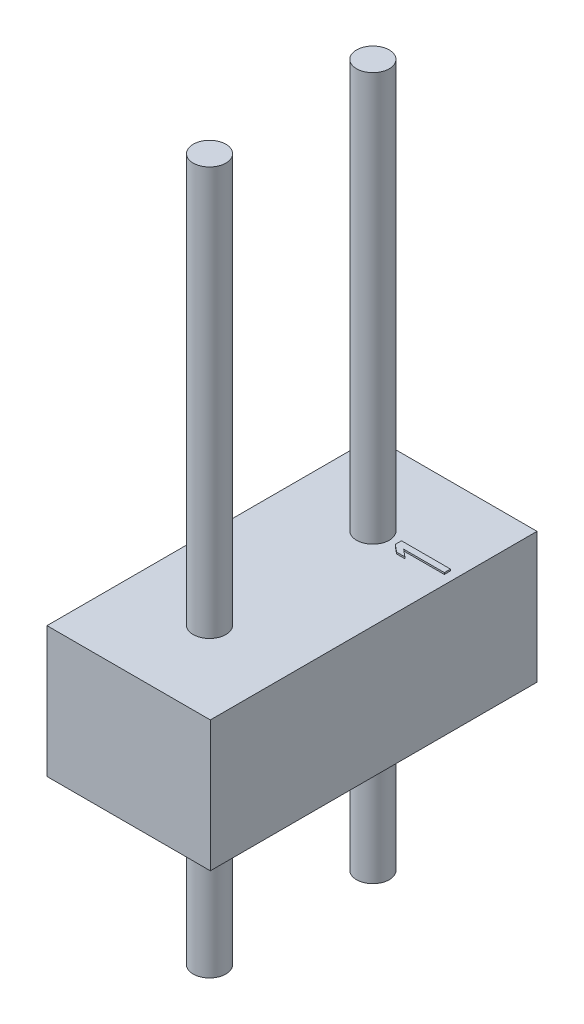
ISO-10303-21;
HEADER;
FILE_DESCRIPTION(('STEP AP214'),'2;1');
FILE_NAME('part.step','',(''),(''),'','','');
FILE_SCHEMA(('AUTOMOTIVE_DESIGN { 1 0 10303 214 1 1 1 1 }'));
ENDSEC;
DATA;
#1=APPLICATION_CONTEXT('core data for automotive mechanical design processes');
#2=APPLICATION_PROTOCOL_DEFINITION('international standard','automotive_design',2000,#1);
#3=PRODUCT_CONTEXT('',#1,'mechanical');
#4=PRODUCT('Part','Part','',(#3));
#5=PRODUCT_RELATED_PRODUCT_CATEGORY('part','',(#4));
#6=PRODUCT_DEFINITION_FORMATION('','',#4);
#7=PRODUCT_DEFINITION_CONTEXT('part definition',#1,'design');
#8=PRODUCT_DEFINITION('design','',#6,#7);
#9=PRODUCT_DEFINITION_SHAPE('','',#8);
#10=(LENGTH_UNIT() NAMED_UNIT(*) SI_UNIT(.MILLI.,.METRE.));
#11=(NAMED_UNIT(*) PLANE_ANGLE_UNIT() SI_UNIT($,.RADIAN.));
#12=(NAMED_UNIT(*) SI_UNIT($,.STERADIAN.) SOLID_ANGLE_UNIT());
#13=UNCERTAINTY_MEASURE_WITH_UNIT(LENGTH_MEASURE(1.E-05),#10,'distance_accuracy_value','');
#14=(GEOMETRIC_REPRESENTATION_CONTEXT(3) GLOBAL_UNCERTAINTY_ASSIGNED_CONTEXT((#13)) GLOBAL_UNIT_ASSIGNED_CONTEXT((#10,
#11,#12)) REPRESENTATION_CONTEXT('',''));
#15=CARTESIAN_POINT('',(0.,0.,0.));
#16=DIRECTION('',(0.,0.,1.));
#17=DIRECTION('',(1.,0.,0.));
#18=AXIS2_PLACEMENT_3D('',#15,#16,#17);
#19=CARTESIAN_POINT('',(34.0212274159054,9.906,-11.1144895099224));
#20=DIRECTION('',(0.,1.,0.));
#21=DIRECTION('',(1.,0.,0.));
#22=AXIS2_PLACEMENT_3D('',#19,#20,#21);
#23=PLANE('',#22);
#24=CARTESIAN_POINT('',(34.29,9.90599999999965,-13.97));
#25=DIRECTION('',(0.,1.,0.));
#26=DIRECTION('',(0.,0.,1.));
#27=AXIS2_PLACEMENT_3D('',#24,#25,#26);
#28=CIRCLE('',#27,0.253999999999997);
#29=CARTESIAN_POINT('',(34.29,9.90599999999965,-13.716));
#30=VERTEX_POINT('',#29);
#31=EDGE_CURVE('E20',#30,#30,#28,.T.);
#32=ORIENTED_EDGE('',*,*,#31,.T.);
#33=EDGE_LOOP('',(#32));
#34=FACE_BOUND('',#33,.T.);
#35=ADVANCED_FACE('F16',(#34),#23,.T.);
#36=CARTESIAN_POINT('',(34.0212274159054,9.906,-11.1144895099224));
#37=DIRECTION('',(0.,1.,0.));
#38=DIRECTION('',(1.,0.,0.));
#39=AXIS2_PLACEMENT_3D('',#36,#37,#38);
#40=PLANE('',#39);
#41=CARTESIAN_POINT('',(34.29,9.90599999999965,-11.43));
#42=DIRECTION('',(0.,1.,0.));
#43=DIRECTION('',(0.,0.,1.));
#44=AXIS2_PLACEMENT_3D('',#41,#42,#43);
#45=CIRCLE('',#44,0.253999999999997);
#46=CARTESIAN_POINT('',(34.29,9.90599999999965,-11.176));
#47=VERTEX_POINT('',#46);
#48=EDGE_CURVE('E162',#47,#47,#45,.T.);
#49=ORIENTED_EDGE('',*,*,#48,.T.);
#50=EDGE_LOOP('',(#49));
#51=FACE_BOUND('',#50,.T.);
#52=ADVANCED_FACE('F305',(#51),#40,.T.);
#53=CARTESIAN_POINT('',(35.44824,3.5814,-13.8282274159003));
#54=DIRECTION('',(0.,1.,0.));
#55=DIRECTION('',(0.,0.,-1.));
#56=AXIS2_PLACEMENT_3D('',#53,#54,#55);
#57=PLANE('',#56);
#58=DIRECTION('',(-1.,0.,0.));
#59=VECTOR('',#58,1.);
#60=CARTESIAN_POINT('',(35.116851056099,3.58140000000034,-13.93825));
#61=LINE('',#60,#59);
#62=CARTESIAN_POINT('',(35.4329999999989,3.58140000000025,-13.9382499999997));
#63=VERTEX_POINT('',#62);
#64=CARTESIAN_POINT('',(34.8007021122,3.58140000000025,-13.9382500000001));
#65=VERTEX_POINT('',#64);
#66=EDGE_CURVE('E143',#63,#65,#61,.T.);
#67=ORIENTED_EDGE('',*,*,#66,.F.);
#68=DIRECTION('',(0.,0.,1.));
#69=VECTOR('',#68,1.);
#70=CARTESIAN_POINT('',(35.433,3.58140000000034,-13.985875));
#71=LINE('',#70,#69);
#72=CARTESIAN_POINT('',(35.433,3.58140000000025,-14.0335000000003));
#73=VERTEX_POINT('',#72);
#74=EDGE_CURVE('E223',#73,#63,#71,.T.);
#75=ORIENTED_EDGE('',*,*,#74,.F.);
#76=DIRECTION('',(1.,0.,0.));
#77=VECTOR('',#76,1.);
#78=CARTESIAN_POINT('',(35.052,3.58140000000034,-14.0335));
#79=LINE('',#78,#77);
#80=CARTESIAN_POINT('',(34.671,3.58140000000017,-14.0335000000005));
#81=VERTEX_POINT('',#80);
#82=EDGE_CURVE('E129',#81,#73,#79,.T.);
#83=ORIENTED_EDGE('',*,*,#82,.F.);
#84=DIRECTION('',(0.,0.,-1.));
#85=VECTOR('',#84,1.);
#86=CARTESIAN_POINT('',(34.671,3.58140000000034,-13.985875));
#87=LINE('',#86,#85);
#88=CARTESIAN_POINT('',(34.6710000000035,3.58140000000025,-13.9382500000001));
#89=VERTEX_POINT('',#88);
#90=EDGE_CURVE('E136',#89,#81,#87,.T.);
#91=ORIENTED_EDGE('',*,*,#90,.F.);
#92=DIRECTION('',(-0.76597421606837,0.,-0.642871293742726));
#93=VECTOR('',#92,1.);
#94=CARTESIAN_POINT('',(34.7277446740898,3.58140000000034,-13.890625));
#95=LINE('',#94,#93);
#96=CARTESIAN_POINT('',(34.7844893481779,3.58140000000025,-13.8429999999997));
#97=VERTEX_POINT('',#96);
#98=EDGE_CURVE('E132',#97,#89,#95,.T.);
#99=ORIENTED_EDGE('',*,*,#98,.F.);
#100=DIRECTION('',(-1.,0.,0.));
#101=VECTOR('',#100,1.);
#102=CARTESIAN_POINT('',(34.8493404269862,3.58140000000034,-13.843));
#103=LINE('',#102,#101);
#104=CARTESIAN_POINT('',(34.9141915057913,3.58140000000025,-13.8429999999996));
#105=VERTEX_POINT('',#104);
#106=EDGE_CURVE('E117',#105,#97,#103,.T.);
#107=ORIENTED_EDGE('',*,*,#106,.F.);
#108=DIRECTION('',(0.765974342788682,0.,0.642871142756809));
#109=VECTOR('',#108,1.);
#110=CARTESIAN_POINT('',(34.8574468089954,3.58140000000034,-13.890625));
#111=LINE('',#110,#109);
#112=EDGE_CURVE('E114',#65,#105,#111,.T.);
#113=ORIENTED_EDGE('',*,*,#112,.F.);
#114=EDGE_LOOP('',(#67,#75,#83,#91,#99,#107,#113));
#115=FACE_BOUND('',#114,.T.);
#116=ADVANCED_FACE('F175',(#115),#57,.T.);
#117=CARTESIAN_POINT('',(34.29,3.55600000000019,-13.97));
#118=DIRECTION('',(0.,1.,0.));
#119=DIRECTION('',(0.,0.,1.));
#120=AXIS2_PLACEMENT_3D('',#117,#118,#119);
#121=CYLINDRICAL_SURFACE('',#120,0.253999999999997);
#122=ORIENTED_EDGE('',*,*,#31,.F.);
#123=EDGE_LOOP('',(#122));
#124=FACE_BOUND('',#123,.T.);
#125=CARTESIAN_POINT('',(34.29,3.55600000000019,-13.97));
#126=DIRECTION('',(0.,1.,0.));
#127=DIRECTION('',(0.,0.,1.));
#128=AXIS2_PLACEMENT_3D('',#125,#126,#127);
#129=CIRCLE('',#128,0.253999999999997);
#130=CARTESIAN_POINT('',(34.29,3.55600000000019,-13.716));
#131=VERTEX_POINT('',#130);
#132=EDGE_CURVE('E159',#131,#131,#129,.F.);
#133=ORIENTED_EDGE('',*,*,#132,.F.);
#134=EDGE_LOOP('',(#133));
#135=FACE_BOUND('',#134,.T.);
#136=ADVANCED_FACE('F171',(#124,#135),#121,.T.);
#137=CARTESIAN_POINT('',(34.29,3.55600000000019,-11.43));
#138=DIRECTION('',(0.,1.,0.));
#139=DIRECTION('',(0.,0.,1.));
#140=AXIS2_PLACEMENT_3D('',#137,#138,#139);
#141=CYLINDRICAL_SURFACE('',#140,0.253999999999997);
#142=ORIENTED_EDGE('',*,*,#48,.F.);
#143=EDGE_LOOP('',(#142));
#144=FACE_BOUND('',#143,.T.);
#145=CARTESIAN_POINT('',(34.29,3.55600000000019,-11.43));
#146=DIRECTION('',(0.,1.,0.));
#147=DIRECTION('',(0.,0.,1.));
#148=AXIS2_PLACEMENT_3D('',#145,#146,#147);
#149=CIRCLE('',#148,0.253999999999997);
#150=CARTESIAN_POINT('',(34.29,3.55600000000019,-11.176));
#151=VERTEX_POINT('',#150);
#152=EDGE_CURVE('E155',#151,#151,#149,.F.);
#153=ORIENTED_EDGE('',*,*,#152,.F.);
#154=EDGE_LOOP('',(#153));
#155=FACE_BOUND('',#154,.T.);
#156=ADVANCED_FACE('F174',(#144,#155),#141,.T.);
#157=CARTESIAN_POINT('',(35.44824,3.54122741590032,-14.0335));
#158=DIRECTION('',(0.,0.,-1.));
#159=DIRECTION('',(-1.,0.,0.));
#160=AXIS2_PLACEMENT_3D('',#157,#158,#159);
#161=PLANE('',#160);
#162=ORIENTED_EDGE('',*,*,#82,.T.);
#163=DIRECTION('',(0.,1.,0.));
#164=VECTOR('',#163,1.);
#165=CARTESIAN_POINT('',(35.433,3.5687,-14.0335000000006));
#166=LINE('',#165,#164);
#167=CARTESIAN_POINT('',(35.4329999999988,3.55599999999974,-14.0335000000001));
#168=VERTEX_POINT('',#167);
#169=EDGE_CURVE('E166',#168,#73,#166,.T.);
#170=ORIENTED_EDGE('',*,*,#169,.F.);
#171=DIRECTION('',(1.,0.,0.));
#172=VECTOR('',#171,1.);
#173=CARTESIAN_POINT('',(34.3020952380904,3.556,-14.0335));
#174=LINE('',#173,#172);
#175=CARTESIAN_POINT('',(34.6709999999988,3.55599999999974,-14.0335000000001));
#176=VERTEX_POINT('',#175);
#177=EDGE_CURVE('E158',#176,#168,#174,.T.);
#178=ORIENTED_EDGE('',*,*,#177,.F.);
#179=DIRECTION('',(0.,-1.,0.));
#180=VECTOR('',#179,1.);
#181=CARTESIAN_POINT('',(34.671,3.5687,-14.0335000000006));
#182=LINE('',#181,#180);
#183=EDGE_CURVE('E161',#81,#176,#182,.T.);
#184=ORIENTED_EDGE('',*,*,#183,.F.);
#185=EDGE_LOOP('',(#162,#170,#178,#184));
#186=FACE_BOUND('',#185,.T.);
#187=ADVANCED_FACE('F248',(#186),#161,.T.);
#188=CARTESIAN_POINT('',(35.433,3.54122741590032,-13.9234774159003));
#189=DIRECTION('',(1.,0.,0.));
#190=DIRECTION('',(0.,0.,-1.));
#191=AXIS2_PLACEMENT_3D('',#188,#189,#190);
#192=PLANE('',#191);
#193=ORIENTED_EDGE('',*,*,#74,.T.);
#194=DIRECTION('',(0.,1.,0.));
#195=VECTOR('',#194,1.);
#196=CARTESIAN_POINT('',(35.4329999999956,3.5687,-13.93825));
#197=LINE('',#196,#195);
#198=CARTESIAN_POINT('',(35.4329999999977,3.55599999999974,-13.9382499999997));
#199=VERTEX_POINT('',#198);
#200=EDGE_CURVE('E220',#199,#63,#197,.T.);
#201=ORIENTED_EDGE('',*,*,#200,.F.);
#202=DIRECTION('',(0.,0.,1.));
#203=VECTOR('',#202,1.);
#204=CARTESIAN_POINT('',(35.4329999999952,3.556,-12.7));
#205=LINE('',#204,#203);
#206=EDGE_CURVE('E141',#168,#199,#205,.T.);
#207=ORIENTED_EDGE('',*,*,#206,.F.);
#208=ORIENTED_EDGE('',*,*,#169,.T.);
#209=EDGE_LOOP('',(#193,#201,#207,#208));
#210=FACE_BOUND('',#209,.T.);
#211=ADVANCED_FACE('F229',(#210),#192,.T.);
#212=CARTESIAN_POINT('',(34.7859295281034,3.54122741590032,-13.93825));
#213=DIRECTION('',(0.,0.,1.));
#214=DIRECTION('',(1.,0.,0.));
#215=AXIS2_PLACEMENT_3D('',#212,#213,#214);
#216=PLANE('',#215);
#217=ORIENTED_EDGE('',*,*,#66,.T.);
#218=DIRECTION('',(0.,1.,0.));
#219=VECTOR('',#218,1.);
#220=CARTESIAN_POINT('',(34.8007021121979,3.5687,-13.9382500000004));
#221=LINE('',#220,#219);
#222=CARTESIAN_POINT('',(34.8007021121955,3.556,-13.9382500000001));
#223=VERTEX_POINT('',#222);
#224=EDGE_CURVE('E142',#223,#65,#221,.T.);
#225=ORIENTED_EDGE('',*,*,#224,.F.);
#226=DIRECTION('',(-1.,0.,0.));
#227=VECTOR('',#226,1.);
#228=CARTESIAN_POINT('',(34.3020952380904,3.556,-13.93825));
#229=LINE('',#228,#227);
#230=EDGE_CURVE('E97',#199,#223,#229,.T.);
#231=ORIENTED_EDGE('',*,*,#230,.F.);
#232=ORIENTED_EDGE('',*,*,#200,.T.);
#233=EDGE_LOOP('',(#217,#225,#231,#232));
#234=FACE_BOUND('',#233,.T.);
#235=ADVANCED_FACE('F239',(#234),#216,.T.);
#236=CARTESIAN_POINT('',(34.9255069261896,3.54122741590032,-13.8335031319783));
#237=DIRECTION('',(0.642871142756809,0.,-0.765974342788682));
#238=DIRECTION('',(-0.765974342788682,0.,-0.642871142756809));
#239=AXIS2_PLACEMENT_3D('',#236,#237,#238);
#240=PLANE('',#239);
#241=ORIENTED_EDGE('',*,*,#112,.T.);
#242=DIRECTION('',(0.,1.,0.));
#243=VECTOR('',#242,1.);
#244=CARTESIAN_POINT('',(34.9141915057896,3.5687,-13.843));
#245=LINE('',#244,#243);
#246=CARTESIAN_POINT('',(34.9141915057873,3.556,-13.843));
#247=VERTEX_POINT('',#246);
#248=EDGE_CURVE('E111',#247,#105,#245,.T.);
#249=ORIENTED_EDGE('',*,*,#248,.F.);
#250=DIRECTION('',(0.765974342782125,0.,0.642871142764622));
#251=VECTOR('',#250,1.);
#252=CARTESIAN_POINT('',(34.8007021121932,3.556,-13.93825));
#253=LINE('',#252,#251);
#254=EDGE_CURVE('E100',#223,#247,#253,.T.);
#255=ORIENTED_EDGE('',*,*,#254,.F.);
#256=ORIENTED_EDGE('',*,*,#224,.T.);
#257=EDGE_LOOP('',(#241,#249,#255,#256));
#258=FACE_BOUND('',#257,.T.);
#259=ADVANCED_FACE('F112',(#258),#240,.T.);
#260=CARTESIAN_POINT('',(34.769716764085,3.54122741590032,-13.843));
#261=DIRECTION('',(0.,0.,1.));
#262=DIRECTION('',(1.,0.,0.));
#263=AXIS2_PLACEMENT_3D('',#260,#261,#262);
#264=PLANE('',#263);
#265=ORIENTED_EDGE('',*,*,#106,.T.);
#266=DIRECTION('',(0.,1.,0.));
#267=VECTOR('',#266,1.);
#268=CARTESIAN_POINT('',(34.7844893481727,3.5687,-13.8429999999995));
#269=LINE('',#268,#267);
#270=CARTESIAN_POINT('',(34.7844893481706,3.556,-13.8429999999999));
#271=VERTEX_POINT('',#270);
#272=EDGE_CURVE('E121',#271,#97,#269,.T.);
#273=ORIENTED_EDGE('',*,*,#272,.F.);
#274=DIRECTION('',(-1.,0.,0.));
#275=VECTOR('',#274,1.);
#276=CARTESIAN_POINT('',(34.3020952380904,3.556,-13.843));
#277=LINE('',#276,#275);
#278=EDGE_CURVE('E105',#247,#271,#277,.T.);
#279=ORIENTED_EDGE('',*,*,#278,.F.);
#280=ORIENTED_EDGE('',*,*,#248,.T.);
#281=EDGE_LOOP('',(#265,#273,#279,#280));
#282=FACE_BOUND('',#281,.T.);
#283=ADVANCED_FACE('F119',(#282),#264,.T.);
#284=CARTESIAN_POINT('',(34.6596845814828,3.54122741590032,-13.9477468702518));
#285=DIRECTION('',(-0.642871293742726,0.,0.76597421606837));
#286=DIRECTION('',(0.76597421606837,0.,0.642871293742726));
#287=AXIS2_PLACEMENT_3D('',#284,#285,#286);
#288=PLANE('',#287);
#289=ORIENTED_EDGE('',*,*,#98,.T.);
#290=DIRECTION('',(0.,1.,0.));
#291=VECTOR('',#290,1.);
#292=CARTESIAN_POINT('',(34.671,3.5687,-13.9382499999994));
#293=LINE('',#292,#291);
#294=CARTESIAN_POINT('',(34.6709999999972,3.556,-13.9382499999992));
#295=VERTEX_POINT('',#294);
#296=EDGE_CURVE('E133',#295,#89,#293,.T.);
#297=ORIENTED_EDGE('',*,*,#296,.F.);
#298=DIRECTION('',(-0.765974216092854,0.,-0.642871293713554));
#299=VECTOR('',#298,1.);
#300=CARTESIAN_POINT('',(34.7844893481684,3.556,-13.843));
#301=LINE('',#300,#299);
#302=EDGE_CURVE('E123',#271,#295,#301,.T.);
#303=ORIENTED_EDGE('',*,*,#302,.F.);
#304=ORIENTED_EDGE('',*,*,#272,.T.);
#305=EDGE_LOOP('',(#289,#297,#303,#304));
#306=FACE_BOUND('',#305,.T.);
#307=ADVANCED_FACE('F317',(#306),#288,.T.);
#308=CARTESIAN_POINT('',(34.671,3.54122741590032,-14.0482725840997));
#309=DIRECTION('',(-1.,0.,0.));
#310=DIRECTION('',(0.,0.,1.));
#311=AXIS2_PLACEMENT_3D('',#308,#309,#310);
#312=PLANE('',#311);
#313=ORIENTED_EDGE('',*,*,#90,.T.);
#314=ORIENTED_EDGE('',*,*,#183,.T.);
#315=DIRECTION('',(0.,0.,-1.));
#316=VECTOR('',#315,1.);
#317=CARTESIAN_POINT('',(34.6709999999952,3.556,-12.7));
#318=LINE('',#317,#316);
#319=EDGE_CURVE('E125',#295,#176,#318,.T.);
#320=ORIENTED_EDGE('',*,*,#319,.F.);
#321=ORIENTED_EDGE('',*,*,#296,.T.);
#322=EDGE_LOOP('',(#313,#314,#320,#321));
#323=FACE_BOUND('',#322,.T.);
#324=ADVANCED_FACE('F182',(#323),#312,.T.);
#325=CARTESIAN_POINT('',(32.9812952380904,3.556,-10.0584));
#326=DIRECTION('',(0.,1.,0.));
#327=DIRECTION('',(1.,0.,0.));
#328=AXIS2_PLACEMENT_3D('',#325,#326,#327);
#329=PLANE('',#328);
#330=ORIENTED_EDGE('',*,*,#302,.T.);
#331=ORIENTED_EDGE('',*,*,#319,.T.);
#332=ORIENTED_EDGE('',*,*,#177,.T.);
#333=ORIENTED_EDGE('',*,*,#206,.T.);
#334=ORIENTED_EDGE('',*,*,#230,.T.);
#335=ORIENTED_EDGE('',*,*,#254,.T.);
#336=ORIENTED_EDGE('',*,*,#278,.T.);
#337=EDGE_LOOP('',(#330,#331,#332,#333,#334,#335,#336));
#338=FACE_BOUND('',#337,.T.);
#339=ORIENTED_EDGE('',*,*,#152,.T.);
#340=EDGE_LOOP('',(#339));
#341=FACE_BOUND('',#340,.T.);
#342=ORIENTED_EDGE('',*,*,#132,.T.);
#343=EDGE_LOOP('',(#342));
#344=FACE_BOUND('',#343,.T.);
#345=DIRECTION('',(0.,0.,1.));
#346=VECTOR('',#345,1.);
#347=CARTESIAN_POINT('',(35.5720952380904,3.556,-12.7));
#348=LINE('',#347,#346);
#349=CARTESIAN_POINT('',(35.5720952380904,3.556,-15.24));
#350=VERTEX_POINT('',#349);
#351=CARTESIAN_POINT('',(35.5720952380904,3.556,-10.16));
#352=VERTEX_POINT('',#351);
#353=EDGE_CURVE('E187',#350,#352,#348,.T.);
#354=ORIENTED_EDGE('',*,*,#353,.F.);
#355=DIRECTION('',(1.,0.,0.));
#356=VECTOR('',#355,1.);
#357=CARTESIAN_POINT('',(34.3020952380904,3.556,-15.24));
#358=LINE('',#357,#356);
#359=CARTESIAN_POINT('',(33.0320952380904,3.556,-15.24));
#360=VERTEX_POINT('',#359);
#361=EDGE_CURVE('E189',#360,#350,#358,.T.);
#362=ORIENTED_EDGE('',*,*,#361,.F.);
#363=DIRECTION('',(0.,0.,-1.));
#364=VECTOR('',#363,1.);
#365=CARTESIAN_POINT('',(33.0320952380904,3.556,-12.7));
#366=LINE('',#365,#364);
#367=CARTESIAN_POINT('',(33.0320952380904,3.556,-10.16));
#368=VERTEX_POINT('',#367);
#369=EDGE_CURVE('E139',#368,#360,#366,.T.);
#370=ORIENTED_EDGE('',*,*,#369,.F.);
#371=DIRECTION('',(-1.,0.,0.));
#372=VECTOR('',#371,1.);
#373=CARTESIAN_POINT('',(34.3020952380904,3.556,-10.16));
#374=LINE('',#373,#372);
#375=EDGE_CURVE('E190',#352,#368,#374,.T.);
#376=ORIENTED_EDGE('',*,*,#375,.F.);
#377=EDGE_LOOP('',(#354,#362,#370,#376));
#378=FACE_BOUND('',#377,.T.);
#379=ADVANCED_FACE('F102',(#338,#341,#344,#378),#329,.T.);
#380=CARTESIAN_POINT('',(34.0212274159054,-1.016,-11.1144895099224));
#381=DIRECTION('',(0.,1.,0.));
#382=DIRECTION('',(1.,0.,0.));
#383=AXIS2_PLACEMENT_3D('',#380,#381,#382);
#384=PLANE('',#383);
#385=CARTESIAN_POINT('',(34.29,-1.01599999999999,-13.97));
#386=DIRECTION('',(0.,1.,0.));
#387=DIRECTION('',(0.,0.,1.));
#388=AXIS2_PLACEMENT_3D('',#385,#386,#387);
#389=CIRCLE('',#388,0.253999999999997);
#390=CARTESIAN_POINT('',(34.29,-1.01599999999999,-13.716));
#391=VERTEX_POINT('',#390);
#392=EDGE_CURVE('E152',#391,#391,#389,.F.);
#393=ORIENTED_EDGE('',*,*,#392,.T.);
#394=EDGE_LOOP('',(#393));
#395=FACE_BOUND('',#394,.T.);
#396=ADVANCED_FACE('F181',(#395),#384,.F.);
#397=CARTESIAN_POINT('',(34.0212274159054,-1.016,-11.1144895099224));
#398=DIRECTION('',(0.,1.,0.));
#399=DIRECTION('',(1.,0.,0.));
#400=AXIS2_PLACEMENT_3D('',#397,#398,#399);
#401=PLANE('',#400);
#402=CARTESIAN_POINT('',(34.29,-1.01599999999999,-11.43));
#403=DIRECTION('',(0.,1.,0.));
#404=DIRECTION('',(0.,0.,1.));
#405=AXIS2_PLACEMENT_3D('',#402,#403,#404);
#406=CIRCLE('',#405,0.253999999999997);
#407=CARTESIAN_POINT('',(34.29,-1.01599999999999,-11.176));
#408=VERTEX_POINT('',#407);
#409=EDGE_CURVE('E148',#408,#408,#406,.F.);
#410=ORIENTED_EDGE('',*,*,#409,.T.);
#411=EDGE_LOOP('',(#410));
#412=FACE_BOUND('',#411,.T.);
#413=ADVANCED_FACE('F277',(#412),#401,.F.);
#414=CARTESIAN_POINT('',(33.0320952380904,1.48336,-15.3416));
#415=DIRECTION('',(-1.,0.,0.));
#416=DIRECTION('',(0.,0.,1.));
#417=AXIS2_PLACEMENT_3D('',#414,#415,#416);
#418=PLANE('',#417);
#419=ORIENTED_EDGE('',*,*,#369,.T.);
#420=DIRECTION('',(0.,1.,0.));
#421=VECTOR('',#420,1.);
#422=CARTESIAN_POINT('',(33.0320952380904,2.54,-15.24));
#423=LINE('',#422,#421);
#424=CARTESIAN_POINT('',(33.0320952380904,1.524,-15.24));
#425=VERTEX_POINT('',#424);
#426=EDGE_CURVE('E201',#425,#360,#423,.T.);
#427=ORIENTED_EDGE('',*,*,#426,.F.);
#428=DIRECTION('',(0.,0.,1.));
#429=VECTOR('',#428,1.);
#430=CARTESIAN_POINT('',(33.0320952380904,1.524,-12.7));
#431=LINE('',#430,#429);
#432=CARTESIAN_POINT('',(33.0320952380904,1.524,-10.16));
#433=VERTEX_POINT('',#432);
#434=EDGE_CURVE('E151',#425,#433,#431,.T.);
#435=ORIENTED_EDGE('',*,*,#434,.T.);
#436=DIRECTION('',(0.,-1.,0.));
#437=VECTOR('',#436,1.);
#438=CARTESIAN_POINT('',(33.0320952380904,2.54,-10.16));
#439=LINE('',#438,#437);
#440=EDGE_CURVE('E194',#368,#433,#439,.T.);
#441=ORIENTED_EDGE('',*,*,#440,.F.);
#442=EDGE_LOOP('',(#419,#427,#435,#441));
#443=FACE_BOUND('',#442,.T.);
#444=ADVANCED_FACE('F275',(#443),#418,.T.);
#445=CARTESIAN_POINT('',(32.9812952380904,1.48336,-10.16));
#446=DIRECTION('',(0.,0.,1.));
#447=DIRECTION('',(1.,0.,0.));
#448=AXIS2_PLACEMENT_3D('',#445,#446,#447);
#449=PLANE('',#448);
#450=ORIENTED_EDGE('',*,*,#375,.T.);
#451=ORIENTED_EDGE('',*,*,#440,.T.);
#452=DIRECTION('',(1.,0.,0.));
#453=VECTOR('',#452,1.);
#454=CARTESIAN_POINT('',(34.3020952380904,1.524,-10.16));
#455=LINE('',#454,#453);
#456=CARTESIAN_POINT('',(35.5720952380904,1.524,-10.16));
#457=VERTEX_POINT('',#456);
#458=EDGE_CURVE('E265',#433,#457,#455,.T.);
#459=ORIENTED_EDGE('',*,*,#458,.T.);
#460=DIRECTION('',(0.,-1.,0.));
#461=VECTOR('',#460,1.);
#462=CARTESIAN_POINT('',(35.5720952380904,2.54,-10.16));
#463=LINE('',#462,#461);
#464=EDGE_CURVE('E193',#352,#457,#463,.T.);
#465=ORIENTED_EDGE('',*,*,#464,.F.);
#466=EDGE_LOOP('',(#450,#451,#459,#465));
#467=FACE_BOUND('',#466,.T.);
#468=ADVANCED_FACE('F269',(#467),#449,.T.);
#469=CARTESIAN_POINT('',(35.5720952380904,1.48336,-10.0584));
#470=DIRECTION('',(1.,0.,0.));
#471=DIRECTION('',(0.,0.,-1.));
#472=AXIS2_PLACEMENT_3D('',#469,#470,#471);
#473=PLANE('',#472);
#474=ORIENTED_EDGE('',*,*,#353,.T.);
#475=ORIENTED_EDGE('',*,*,#464,.T.);
#476=DIRECTION('',(0.,0.,-1.));
#477=VECTOR('',#476,1.);
#478=CARTESIAN_POINT('',(35.5720952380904,1.524,-12.7));
#479=LINE('',#478,#477);
#480=CARTESIAN_POINT('',(35.5720952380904,1.524,-15.24));
#481=VERTEX_POINT('',#480);
#482=EDGE_CURVE('E199',#457,#481,#479,.T.);
#483=ORIENTED_EDGE('',*,*,#482,.T.);
#484=DIRECTION('',(0.,-1.,0.));
#485=VECTOR('',#484,1.);
#486=CARTESIAN_POINT('',(35.5720952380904,2.54,-15.24));
#487=LINE('',#486,#485);
#488=EDGE_CURVE('E35',#350,#481,#487,.T.);
#489=ORIENTED_EDGE('',*,*,#488,.F.);
#490=EDGE_LOOP('',(#474,#475,#483,#489));
#491=FACE_BOUND('',#490,.T.);
#492=ADVANCED_FACE('F197',(#491),#473,.T.);
#493=CARTESIAN_POINT('',(35.6228952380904,1.48336,-15.24));
#494=DIRECTION('',(0.,0.,-1.));
#495=DIRECTION('',(-1.,0.,0.));
#496=AXIS2_PLACEMENT_3D('',#493,#494,#495);
#497=PLANE('',#496);
#498=ORIENTED_EDGE('',*,*,#361,.T.);
#499=ORIENTED_EDGE('',*,*,#488,.T.);
#500=DIRECTION('',(-1.,0.,0.));
#501=VECTOR('',#500,1.);
#502=CARTESIAN_POINT('',(34.3020952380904,1.524,-15.24));
#503=LINE('',#502,#501);
#504=EDGE_CURVE('E147',#481,#425,#503,.T.);
#505=ORIENTED_EDGE('',*,*,#504,.T.);
#506=ORIENTED_EDGE('',*,*,#426,.T.);
#507=EDGE_LOOP('',(#498,#499,#505,#506));
#508=FACE_BOUND('',#507,.T.);
#509=ADVANCED_FACE('F272',(#508),#497,.T.);
#510=CARTESIAN_POINT('',(34.29,-1.01599999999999,-13.97));
#511=DIRECTION('',(0.,1.,0.));
#512=DIRECTION('',(0.,0.,1.));
#513=AXIS2_PLACEMENT_3D('',#510,#511,#512);
#514=CYLINDRICAL_SURFACE('',#513,0.253999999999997);
#515=ORIENTED_EDGE('',*,*,#392,.F.);
#516=EDGE_LOOP('',(#515));
#517=FACE_BOUND('',#516,.T.);
#518=CARTESIAN_POINT('',(34.29,1.52400000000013,-13.97));
#519=DIRECTION('',(0.,1.,0.));
#520=DIRECTION('',(0.,0.,1.));
#521=AXIS2_PLACEMENT_3D('',#518,#519,#520);
#522=CIRCLE('',#521,0.253999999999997);
#523=CARTESIAN_POINT('',(34.29,1.52400000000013,-13.716));
#524=VERTEX_POINT('',#523);
#525=EDGE_CURVE('E26',#524,#524,#522,.F.);
#526=ORIENTED_EDGE('',*,*,#525,.T.);
#527=EDGE_LOOP('',(#526));
#528=FACE_BOUND('',#527,.T.);
#529=ADVANCED_FACE('F256',(#517,#528),#514,.T.);
#530=CARTESIAN_POINT('',(34.29,-1.01599999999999,-11.43));
#531=DIRECTION('',(0.,1.,0.));
#532=DIRECTION('',(0.,0.,1.));
#533=AXIS2_PLACEMENT_3D('',#530,#531,#532);
#534=CYLINDRICAL_SURFACE('',#533,0.253999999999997);
#535=ORIENTED_EDGE('',*,*,#409,.F.);
#536=EDGE_LOOP('',(#535));
#537=FACE_BOUND('',#536,.T.);
#538=CARTESIAN_POINT('',(34.29,1.52400000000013,-11.43));
#539=DIRECTION('',(0.,1.,0.));
#540=DIRECTION('',(0.,0.,1.));
#541=AXIS2_PLACEMENT_3D('',#538,#539,#540);
#542=CIRCLE('',#541,0.253999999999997);
#543=CARTESIAN_POINT('',(34.29,1.52400000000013,-11.176));
#544=VERTEX_POINT('',#543);
#545=EDGE_CURVE('E11',#544,#544,#542,.F.);
#546=ORIENTED_EDGE('',*,*,#545,.T.);
#547=EDGE_LOOP('',(#546));
#548=FACE_BOUND('',#547,.T.);
#549=ADVANCED_FACE('F251',(#537,#548),#534,.T.);
#550=CARTESIAN_POINT('',(32.9812952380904,1.524,-10.0584));
#551=DIRECTION('',(0.,1.,0.));
#552=DIRECTION('',(1.,0.,0.));
#553=AXIS2_PLACEMENT_3D('',#550,#551,#552);
#554=PLANE('',#553);
#555=ORIENTED_EDGE('',*,*,#545,.F.);
#556=EDGE_LOOP('',(#555));
#557=FACE_BOUND('',#556,.T.);
#558=ORIENTED_EDGE('',*,*,#525,.F.);
#559=EDGE_LOOP('',(#558));
#560=FACE_BOUND('',#559,.T.);
#561=ORIENTED_EDGE('',*,*,#482,.F.);
#562=ORIENTED_EDGE('',*,*,#458,.F.);
#563=ORIENTED_EDGE('',*,*,#434,.F.);
#564=ORIENTED_EDGE('',*,*,#504,.F.);
#565=EDGE_LOOP('',(#561,#562,#563,#564));
#566=FACE_BOUND('',#565,.T.);
#567=ADVANCED_FACE('F18',(#557,#560,#566),#554,.F.);
#568=CLOSED_SHELL('',(#35,#52,#116,#136,#156,#187,#211,#235,#259,#283,#307,#324,#379,#396,#413,
#444,#468,#492,#509,#529,#549,#567));
#569=MANIFOLD_SOLID_BREP('B1',#568);
#570=ADVANCED_BREP_SHAPE_REPRESENTATION('',(#18,#569),#14);
#571=SHAPE_DEFINITION_REPRESENTATION(#9,#570);
ENDSEC;
END-ISO-10303-21;
